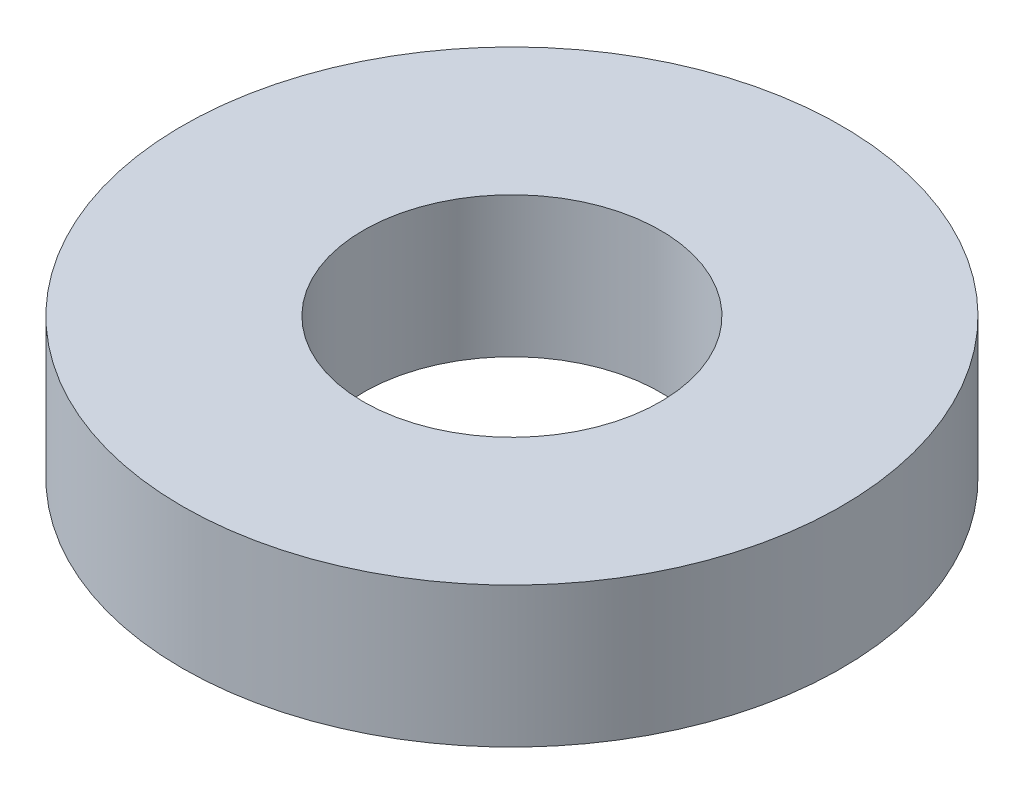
ISO-10303-21;
HEADER;
FILE_DESCRIPTION(('STEP AP214'),'2;1');
FILE_NAME('part.step','',(''),(''),'','','');
FILE_SCHEMA(('AUTOMOTIVE_DESIGN { 1 0 10303 214 1 1 1 1 }'));
ENDSEC;
DATA;
#1=APPLICATION_CONTEXT('core data for automotive mechanical design processes');
#2=APPLICATION_PROTOCOL_DEFINITION('international standard','automotive_design',2000,#1);
#3=PRODUCT_CONTEXT('',#1,'mechanical');
#4=PRODUCT('Part','Part','',(#3));
#5=PRODUCT_RELATED_PRODUCT_CATEGORY('part','',(#4));
#6=PRODUCT_DEFINITION_FORMATION('','',#4);
#7=PRODUCT_DEFINITION_CONTEXT('part definition',#1,'design');
#8=PRODUCT_DEFINITION('design','',#6,#7);
#9=PRODUCT_DEFINITION_SHAPE('','',#8);
#10=(LENGTH_UNIT() NAMED_UNIT(*) SI_UNIT(.MILLI.,.METRE.));
#11=(NAMED_UNIT(*) PLANE_ANGLE_UNIT() SI_UNIT($,.RADIAN.));
#12=(NAMED_UNIT(*) SI_UNIT($,.STERADIAN.) SOLID_ANGLE_UNIT());
#13=UNCERTAINTY_MEASURE_WITH_UNIT(LENGTH_MEASURE(1.E-05),#10,'distance_accuracy_value','');
#14=(GEOMETRIC_REPRESENTATION_CONTEXT(3) GLOBAL_UNCERTAINTY_ASSIGNED_CONTEXT((#13)) GLOBAL_UNIT_ASSIGNED_CONTEXT((#10,
#11,#12)) REPRESENTATION_CONTEXT('',''));
#15=CARTESIAN_POINT('',(0.,0.,0.));
#16=DIRECTION('',(0.,0.,1.));
#17=DIRECTION('',(1.,0.,0.));
#18=AXIS2_PLACEMENT_3D('',#15,#16,#17);
#19=CARTESIAN_POINT('',(0.,2.895,0.));
#20=DIRECTION('',(0.,1.,0.));
#21=DIRECTION('',(0.,0.,1.));
#22=AXIS2_PLACEMENT_3D('',#19,#20,#21);
#23=PLANE('',#22);
#24=CARTESIAN_POINT('',(0.,2.895,0.));
#25=DIRECTION('',(0.,1.,0.));
#26=DIRECTION('',(0.,0.,1.));
#27=AXIS2_PLACEMENT_3D('',#24,#25,#26);
#28=CIRCLE('',#27,13.6);
#29=CARTESIAN_POINT('',(0.,2.895,13.6));
#30=VERTEX_POINT('',#29);
#31=EDGE_CURVE('E10',#30,#30,#28,.T.);
#32=ORIENTED_EDGE('',*,*,#31,.T.);
#33=EDGE_LOOP('',(#32));
#34=FACE_BOUND('',#33,.T.);
#35=CARTESIAN_POINT('',(0.,2.895,0.));
#36=DIRECTION('',(0.,1.,0.));
#37=DIRECTION('',(0.,0.,1.));
#38=AXIS2_PLACEMENT_3D('',#35,#36,#37);
#39=CIRCLE('',#38,6.13);
#40=CARTESIAN_POINT('',(0.,2.895,6.13));
#41=VERTEX_POINT('',#40);
#42=EDGE_CURVE('E56',#41,#41,#39,.T.);
#43=ORIENTED_EDGE('',*,*,#42,.F.);
#44=EDGE_LOOP('',(#43));
#45=FACE_BOUND('',#44,.T.);
#46=ADVANCED_FACE('F43',(#34,#45),#23,.T.);
#47=CARTESIAN_POINT('',(0.,-2.895,0.));
#48=DIRECTION('',(0.,1.,0.));
#49=DIRECTION('',(0.,0.,1.));
#50=AXIS2_PLACEMENT_3D('',#47,#48,#49);
#51=PLANE('',#50);
#52=CARTESIAN_POINT('',(0.,-2.895,0.));
#53=DIRECTION('',(0.,1.,0.));
#54=DIRECTION('',(0.,0.,1.));
#55=AXIS2_PLACEMENT_3D('',#52,#53,#54);
#56=CIRCLE('',#55,13.6);
#57=CARTESIAN_POINT('',(0.,-2.895,13.6));
#58=VERTEX_POINT('',#57);
#59=EDGE_CURVE('E47',#58,#58,#56,.T.);
#60=ORIENTED_EDGE('',*,*,#59,.F.);
#61=EDGE_LOOP('',(#60));
#62=FACE_BOUND('',#61,.T.);
#63=CARTESIAN_POINT('',(0.,-2.895,0.));
#64=DIRECTION('',(0.,1.,0.));
#65=DIRECTION('',(0.,0.,1.));
#66=AXIS2_PLACEMENT_3D('',#63,#64,#65);
#67=CIRCLE('',#66,6.13);
#68=CARTESIAN_POINT('',(0.,-2.895,6.13));
#69=VERTEX_POINT('',#68);
#70=EDGE_CURVE('E58',#69,#69,#67,.T.);
#71=ORIENTED_EDGE('',*,*,#70,.T.);
#72=EDGE_LOOP('',(#71));
#73=FACE_BOUND('',#72,.T.);
#74=ADVANCED_FACE('F70',(#62,#73),#51,.F.);
#75=CARTESIAN_POINT('',(0.,2.895,0.));
#76=DIRECTION('',(0.,-1.,0.));
#77=DIRECTION('',(0.,0.,-1.));
#78=AXIS2_PLACEMENT_3D('',#75,#76,#77);
#79=CYLINDRICAL_SURFACE('',#78,13.6);
#80=ORIENTED_EDGE('',*,*,#31,.F.);
#81=EDGE_LOOP('',(#80));
#82=FACE_BOUND('',#81,.T.);
#83=ORIENTED_EDGE('',*,*,#59,.T.);
#84=EDGE_LOOP('',(#83));
#85=FACE_BOUND('',#84,.T.);
#86=ADVANCED_FACE('F45',(#82,#85),#79,.T.);
#87=CARTESIAN_POINT('',(0.,2.895,0.));
#88=DIRECTION('',(0.,-1.,0.));
#89=DIRECTION('',(0.,0.,-1.));
#90=AXIS2_PLACEMENT_3D('',#87,#88,#89);
#91=CYLINDRICAL_SURFACE('',#90,6.13);
#92=ORIENTED_EDGE('',*,*,#42,.T.);
#93=EDGE_LOOP('',(#92));
#94=FACE_BOUND('',#93,.T.);
#95=ORIENTED_EDGE('',*,*,#70,.F.);
#96=EDGE_LOOP('',(#95));
#97=FACE_BOUND('',#96,.T.);
#98=ADVANCED_FACE('F66',(#94,#97),#91,.F.);
#99=CLOSED_SHELL('',(#46,#74,#86,#98));
#100=MANIFOLD_SOLID_BREP('B2',#99);
#101=ADVANCED_BREP_SHAPE_REPRESENTATION('',(#18,#100),#14);
#102=SHAPE_DEFINITION_REPRESENTATION(#9,#101);
ENDSEC;
END-ISO-10303-21;
